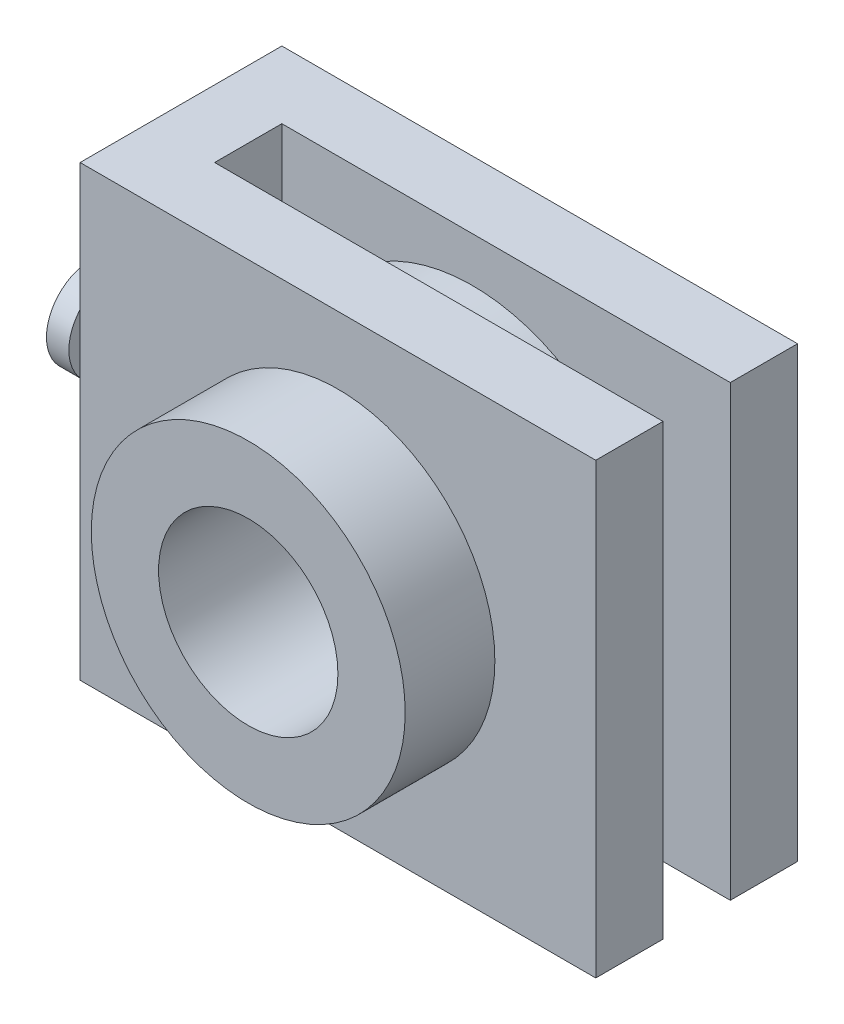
from build123d import *

# Parameters (mm, degrees)
SKETCH1_W           = 20
SKETCH1_H           = 20
BOSS_EXTRUDE1_DEPTH = 3
SKETCH2_W           = 3
SKETCH2_H           = 20
BOSS_EXTRUDE2_DEPTH = 20
SKETCH3_W           = 9
SKETCH3_H           = 20
BOSS_EXTRUDE3_DEPTH = 3
SKETCH4_R           = 1.5
BOSS_EXTRUDE4_DEPTH = 3
SKETCH5_R           = 2
BOSS_EXTRUDE5_DEPTH = 1
SKETCH6_R           = 7
CUT_EXTRUDE1_DEPTH  = 10
SKETCH7_R           = 8
SKETCH7_R_2         = 4
BOSS_EXTRUDE7_DEPTH = 3
BOSS_EXTRUDE8_START = 10
SKETCH8_R           = 7
SKETCH8_R_2         = 4
BOSS_EXTRUDE8_DEPTH = 10


with BuildPart() as part:
    # Sketch1 → Boss-Extrude1 (new body)
    with BuildSketch(Plane.XY):
        Rectangle(SKETCH1_W, SKETCH1_H)
    extrude(amount=BOSS_EXTRUDE1_DEPTH)



with BuildPart() as body_2:
    # Sketch2 → Boss-Extrude2 (new body)
    with BuildSketch(Plane(origin=(10, 0, 0), x_dir=(0, 0, -1), z_dir=(1, 0, 0))):
        with Locations((4.5, 0)):
            Rectangle(SKETCH2_W, SKETCH2_H)
    extrude(amount=-BOSS_EXTRUDE2_DEPTH)


with BuildPart() as part_1:
    add(part.part)

    add(body_2.part)  # Boss-Extrude3 merges body 2
    # Sketch3 → Boss-Extrude3 (add)
    with BuildSketch(Plane.ZY.offset(10)):
        with Locations((-1.5, 0)):
            Rectangle(SKETCH3_W, SKETCH3_H)
    extrude(amount=BOSS_EXTRUDE3_DEPTH)

    # Sketch4 → Boss-Extrude4 (add)
    with BuildSketch(Plane.ZY.offset(13)):
        with Locations((-1.5, 0)):
            Circle(SKETCH4_R)
    extrude(amount=BOSS_EXTRUDE4_DEPTH)

    # Sketch5 → Boss-Extrude5 (add)
    with BuildSketch(Plane.ZY.offset(16)):
        with Locations((-1.5, 0)):
            Circle(SKETCH5_R)
    extrude(amount=BOSS_EXTRUDE5_DEPTH)

    # Sketch6 → Cut-Extrude1 (cut)
    with BuildSketch(Plane.XY.offset(3)):
        with Locations((-1.5, 0)):
            Circle(SKETCH6_R)
    extrude(amount=-CUT_EXTRUDE1_DEPTH, mode=Mode.SUBTRACT)

    # Sketch7 → Boss-Extrude7 (add)
    with BuildSketch(Plane.XY.offset(-3)):
        with Locations((-1.5, 0)):
            Circle(SKETCH7_R)
        with Locations((-1.5, 0)):
            Circle(SKETCH7_R_2, mode=Mode.SUBTRACT)
    extrude(amount=BOSS_EXTRUDE7_DEPTH)

    # Sketch8 → Boss-Extrude8 (add)
    with BuildSketch(Plane.XY.offset(-3).offset(BOSS_EXTRUDE8_START)):
        with Locations((-1.5, 0)):
            Circle(SKETCH8_R)
        with Locations((-1.5, 0)):
            Circle(SKETCH8_R_2, mode=Mode.SUBTRACT)
    extrude(amount=-BOSS_EXTRUDE8_DEPTH)


solid = part_1.part
